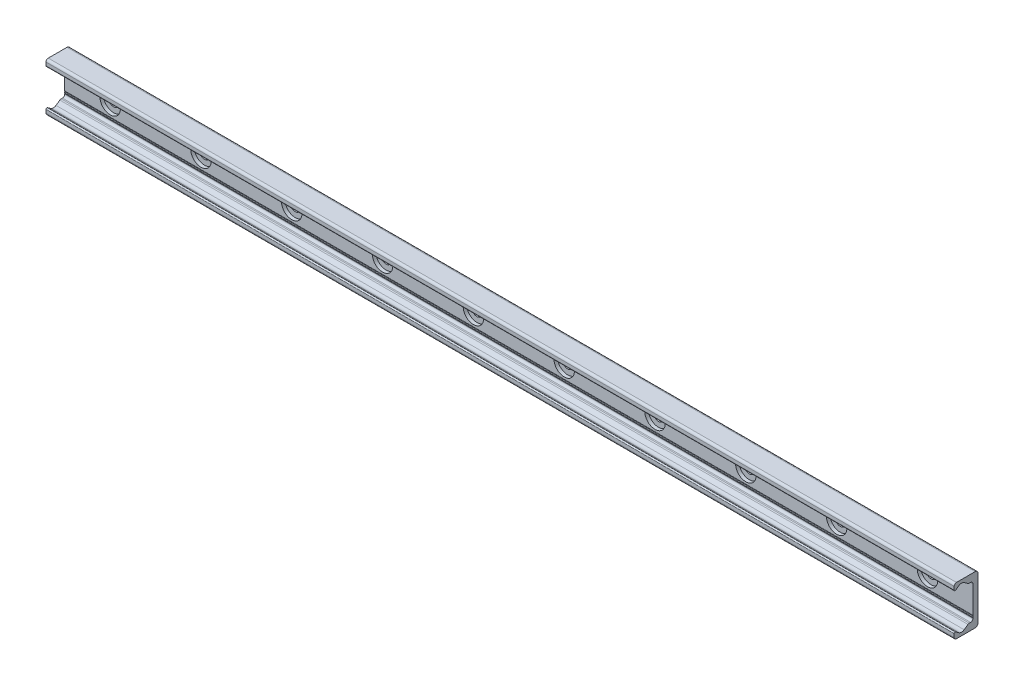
from build123d import *

# Parameters (mm, degrees)
BOSS_EXTRUDE1_DEPTH = 400
SKETCH2_R           = 9
SKETCH2_R_2         = 4.5
CUT_EXTRUDE1_DEPTH  = 3.1
SKETCH2_2_R         = 4.5
CUT_EXTRUDE2_DEPTH  = 401.91707372
LPATTERN1_COUNT     = 10
LPATTERN1_PITCH     = 80


with BuildPart() as part:
    # Sketch1 → Boss-Extrude1 (new, symmetric)
    with BuildSketch(Plane(origin=(0, 0, 0), x_dir=(0, 0, -1), z_dir=(1, 0, 0))):
        with BuildLine():
            Line((0, 0), (0, 19))
            ThreePointArc((0, 19), (-0.732233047, 20.767766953), (-2.5, 21.5))
            Line((-2.5, 21.5), (-19, 21.5))
            ThreePointArc((-19, 21.5), (-20.414213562, 20.914213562), (-21, 19.5))
            Line((-21, 19.5), (-21, 16.625057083))
            ThreePointArc((-21, 16.625057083), (-20.553251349, 15.888838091), (-19.693931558, 15.945160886))
            Line((-19.693931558, 15.945160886), (-16.794305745, 17.975500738))
            ThreePointArc((-16.794305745, 17.975500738), (-14.5, 18.69889256), (-12.205694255, 17.975500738))
            Line((-12.205694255, 17.975500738), (-8.829831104, 15.611695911))
            ThreePointArc((-8.829831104, 15.611695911), (-8.28408983, 15.342566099), (-7.682678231, 15.25))
            Line((-7.682678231, 15.25), (-6.5, 15.25))
            ThreePointArc((-6.5, 15.25), (-5.085786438, 14.664213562), (-4.5, 13.25))
            Line((-4.5, 13.25), (-4.5, -10.75))
            ThreePointArc((-4.5, -10.75), (-4.25, -11), (-4.5, -11.25))
            Line((-4.5, -11.25), (-4.5, -12.25))
            ThreePointArc((-4.5, -12.25), (-4.25, -12.5), (-4.5, -12.75))
            Line((-4.5, -12.75), (-4.5, -13.25))
            ThreePointArc((-4.5, -13.25), (-5.085786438, -14.664213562), (-6.5, -15.25))
            Line((-6.5, -15.25), (-7.682678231, -15.25))
            ThreePointArc((-7.682678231, -15.25), (-8.28408983, -15.342566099), (-8.829831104, -15.611695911))
            Line((-8.829831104, -15.611695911), (-12.205694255, -17.975500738))
            ThreePointArc((-12.205694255, -17.975500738), (-14.5, -18.69889256), (-16.794305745, -17.975500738))
            Line((-16.794305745, -17.975500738), (-19.693931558, -15.945160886))
            ThreePointArc((-19.693931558, -15.945160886), (-20.553251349, -15.888838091), (-21, -16.625057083))
            Line((-21, -16.625057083), (-21, -19.5))
            ThreePointArc((-21, -19.5), (-20.414213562, -20.914213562), (-19, -21.5))
            Line((-19, -21.5), (-2.5, -21.5))
            ThreePointArc((-2.5, -21.5), (-0.732233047, -20.767766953), (0, -19))
            Line((0, -19), (0, 0))
        make_face()
    extrude(amount=BOSS_EXTRUDE1_DEPTH, both=True)

    # Sketch2 → Cut-Extrude1 (cut)
    with BuildSketch(Plane.XY.offset(4.5)):
        with Locations((360, 0)):
            Circle(SKETCH2_R)
        with Locations((360, 0)):
            Circle(SKETCH2_R_2, mode=Mode.SUBTRACT)
    cut_extrude1 = extrude(amount=-CUT_EXTRUDE1_DEPTH, mode=Mode.SUBTRACT)

    # Sketch2_2 → Cut-Extrude2 (cut, through all)
    with BuildSketch(Plane.XY.offset(4.5)):
        with Locations((360, 0)):
            Circle(SKETCH2_2_R)
    cut_extrude2 = extrude(amount=-CUT_EXTRUDE2_DEPTH, mode=Mode.SUBTRACT)

    # LPattern1: Cut-Extrude1, Cut-Extrude2 ×10
    with Locations(*[(-i * LPATTERN1_PITCH, 0, 0) for i in range(1, LPATTERN1_COUNT)]):
        add(cut_extrude1, mode=Mode.SUBTRACT)
        add(cut_extrude2, mode=Mode.SUBTRACT)


solid = part.part
